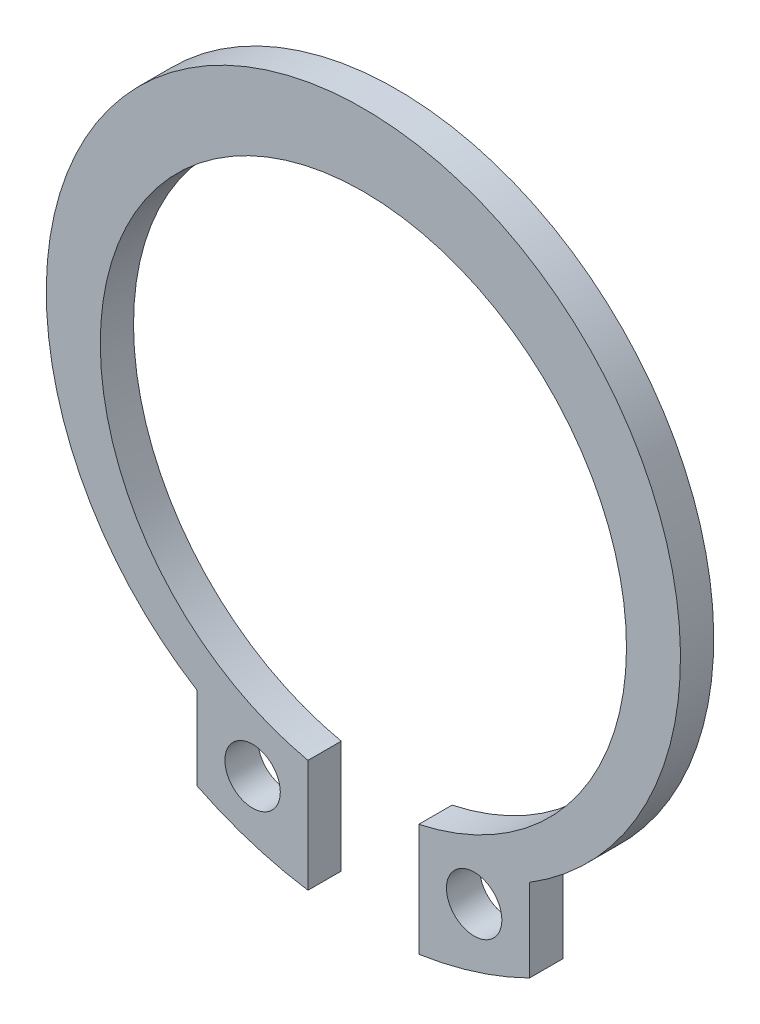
from build123d import *

# Parameters (mm, degrees)
SKETCH1_R           = 1
BOSS_EXTRUDE1_DEPTH = 1.2


with BuildPart() as part:
    # Sketch1 → Boss-Extrude1 (new body)
    with BuildSketch(Plane.XY):
        with BuildLine():
            Line((2, -9.287087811), (2, -13.351029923))
            ThreePointArc((2, -13.351029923), (4.04912542, -12.878454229), (6, -12.093386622))
            Line((6, -12.093386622), (6, -9.102051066))
            ThreePointArc((6, -9.102051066), (0, 12.1), (-6, -9.102051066))
            Line((-6, -9.102051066), (-6, -12.093386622))
            ThreePointArc((-6, -12.093386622), (-4.04912542, -12.878454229), (-2, -13.351029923))
            Line((-2, -13.351029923), (-2, -9.287087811))
            ThreePointArc((-2, -9.287087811), (0, 9.5), (2, -9.287087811))
        make_face()
        with Locations((-4, -10.781929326)):
            Circle(SKETCH1_R, mode=Mode.SUBTRACT)
        with Locations((4, -10.781929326)):
            Circle(SKETCH1_R, mode=Mode.SUBTRACT)
    extrude(amount=BOSS_EXTRUDE1_DEPTH)


solid = part.part
